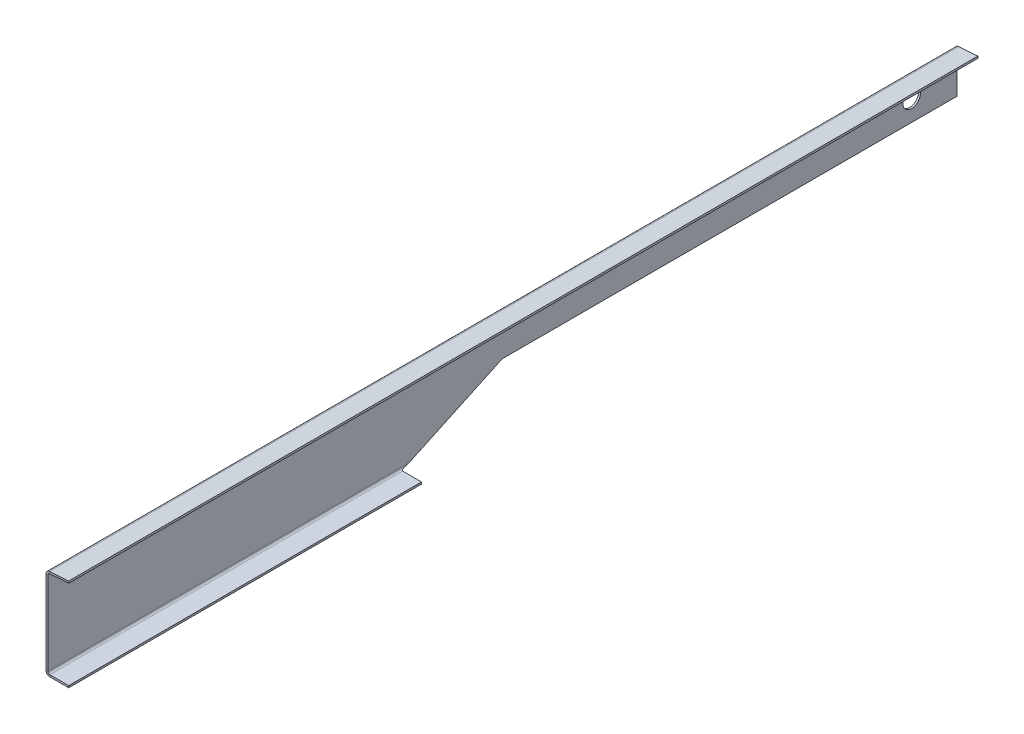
ISO-10303-21;
HEADER;
FILE_DESCRIPTION(('STEP AP214'),'2;1');
FILE_NAME('part.step','',(''),(''),'','','');
FILE_SCHEMA(('AUTOMOTIVE_DESIGN { 1 0 10303 214 1 1 1 1 }'));
ENDSEC;
DATA;
#1=APPLICATION_CONTEXT('core data for automotive mechanical design processes');
#2=APPLICATION_PROTOCOL_DEFINITION('international standard','automotive_design',2000,#1);
#3=PRODUCT_CONTEXT('',#1,'mechanical');
#4=PRODUCT('Part','Part','',(#3));
#5=PRODUCT_RELATED_PRODUCT_CATEGORY('part','',(#4));
#6=PRODUCT_DEFINITION_FORMATION('','',#4);
#7=PRODUCT_DEFINITION_CONTEXT('part definition',#1,'design');
#8=PRODUCT_DEFINITION('design','',#6,#7);
#9=PRODUCT_DEFINITION_SHAPE('','',#8);
#10=(LENGTH_UNIT() NAMED_UNIT(*) SI_UNIT(.MILLI.,.METRE.));
#11=(NAMED_UNIT(*) PLANE_ANGLE_UNIT() SI_UNIT($,.RADIAN.));
#12=(NAMED_UNIT(*) SI_UNIT($,.STERADIAN.) SOLID_ANGLE_UNIT());
#13=UNCERTAINTY_MEASURE_WITH_UNIT(LENGTH_MEASURE(1.E-05),#10,'distance_accuracy_value','');
#14=(GEOMETRIC_REPRESENTATION_CONTEXT(3) GLOBAL_UNCERTAINTY_ASSIGNED_CONTEXT((#13)) GLOBAL_UNIT_ASSIGNED_CONTEXT((#10,
#11,#12)) REPRESENTATION_CONTEXT('',''));
#15=CARTESIAN_POINT('',(0.,0.,0.));
#16=DIRECTION('',(0.,0.,1.));
#17=DIRECTION('',(1.,0.,0.));
#18=AXIS2_PLACEMENT_3D('',#15,#16,#17);
#19=CARTESIAN_POINT('',(12.2570463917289,299.291590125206,-3048.));
#20=DIRECTION('',(0.,0.,-1.));
#21=DIRECTION('',(-1.,0.,0.));
#22=AXIS2_PLACEMENT_3D('',#19,#20,#21);
#23=PLANE('',#22);
#24=DIRECTION('',(0.,1.00000000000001,0.));
#25=VECTOR('',#24,1.);
#26=CARTESIAN_POINT('',(6.35000000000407,0.,-3048.));
#27=LINE('',#26,#25);
#28=CARTESIAN_POINT('',(6.35000000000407,158.75,-3048.));
#29=VERTEX_POINT('',#28);
#30=CARTESIAN_POINT('',(6.35000000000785,292.957058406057,-3048.));
#31=VERTEX_POINT('',#30);
#32=EDGE_CURVE('E135',#29,#31,#27,.T.);
#33=ORIENTED_EDGE('',*,*,#32,.F.);
#34=DIRECTION('',(1.,0.,0.));
#35=VECTOR('',#34,1.);
#36=CARTESIAN_POINT('',(6.35000000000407,158.75,-3048.));
#37=LINE('',#36,#35);
#38=CARTESIAN_POINT('',(3.99680288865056E-12,158.750000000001,-3048.));
#39=VERTEX_POINT('',#38);
#40=EDGE_CURVE('E131',#29,#39,#37,.F.);
#41=ORIENTED_EDGE('',*,*,#40,.T.);
#42=DIRECTION('',(0.,1.00000000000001,0.));
#43=VECTOR('',#42,1.);
#44=CARTESIAN_POINT('',(3.99680288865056E-12,0.,-3048.));
#45=LINE('',#44,#43);
#46=CARTESIAN_POINT('',(7.99360577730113E-12,292.957058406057,-3048.));
#47=VERTEX_POINT('',#46);
#48=EDGE_CURVE('E126',#39,#47,#45,.T.);
#49=ORIENTED_EDGE('',*,*,#48,.T.);
#50=DIRECTION('',(1.,0.,0.));
#51=VECTOR('',#50,1.);
#52=CARTESIAN_POINT('',(7.99360577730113E-12,292.957058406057,-3048.));
#53=LINE('',#52,#51);
#54=EDGE_CURVE('E11',#47,#31,#53,.T.);
#55=ORIENTED_EDGE('',*,*,#54,.T.);
#56=EDGE_LOOP('',(#33,#41,#49,#55));
#57=FACE_BOUND('',#56,.T.);
#58=ADVANCED_FACE('F36',(#57),#23,.T.);
#59=CARTESIAN_POINT('',(6.35000000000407,0.,-3048.));
#60=DIRECTION('',(1.,0.,0.));
#61=DIRECTION('',(0.,0.,-1.));
#62=AXIS2_PLACEMENT_3D('',#59,#60,#61);
#63=PLANE('',#62);
#64=CARTESIAN_POINT('',(6.35000000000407,228.600000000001,-2895.6));
#65=DIRECTION('',(1.,0.,0.));
#66=DIRECTION('',(0.,0.,-1.));
#67=AXIS2_PLACEMENT_3D('',#64,#65,#66);
#68=CIRCLE('',#67,29.3687500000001);
#69=CARTESIAN_POINT('',(6.35000000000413,228.600000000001,-2924.96875));
#70=VERTEX_POINT('',#69);
#71=EDGE_CURVE('E325',#70,#70,#68,.T.);
#72=ORIENTED_EDGE('',*,*,#71,.F.);
#73=EDGE_LOOP('',(#72));
#74=FACE_BOUND('',#73,.T.);
#75=DIRECTION('',(0.,-0.422618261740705,0.906307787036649));
#76=VECTOR('',#75,1.);
#77=CARTESIAN_POINT('',(6.35000000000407,714.456137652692,-2714.84363159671));
#78=LINE('',#77,#76);
#79=CARTESIAN_POINT('',(6.35000000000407,158.750000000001,-1523.12797363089));
#80=VERTEX_POINT('',#79);
#81=CARTESIAN_POINT('',(6.35000000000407,12.7000000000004,-1209.92273789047));
#82=VERTEX_POINT('',#81);
#83=EDGE_CURVE('E308',#80,#82,#78,.T.);
#84=ORIENTED_EDGE('',*,*,#83,.F.);
#85=DIRECTION('',(0.,0.,1.));
#86=VECTOR('',#85,1.);
#87=CARTESIAN_POINT('',(6.35000000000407,158.75,-3048.));
#88=LINE('',#87,#86);
#89=EDGE_CURVE('E302',#29,#80,#88,.T.);
#90=ORIENTED_EDGE('',*,*,#89,.F.);
#91=ORIENTED_EDGE('',*,*,#32,.T.);
#92=DIRECTION('',(0.,0.,1.));
#93=VECTOR('',#92,1.);
#94=CARTESIAN_POINT('',(6.35000000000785,292.957058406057,-3048.));
#95=LINE('',#94,#93);
#96=CARTESIAN_POINT('',(6.35000000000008,292.957058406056,0.));
#97=VERTEX_POINT('',#96);
#98=EDGE_CURVE('E200',#31,#97,#95,.T.);
#99=ORIENTED_EDGE('',*,*,#98,.T.);
#100=DIRECTION('',(0.,1.00000000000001,0.));
#101=VECTOR('',#100,1.);
#102=CARTESIAN_POINT('',(6.35000000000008,0.,0.));
#103=LINE('',#102,#101);
#104=CARTESIAN_POINT('',(6.35000000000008,12.7000000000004,0.));
#105=VERTEX_POINT('',#104);
#106=EDGE_CURVE('E190',#105,#97,#103,.T.);
#107=ORIENTED_EDGE('',*,*,#106,.F.);
#108=DIRECTION('',(0.,0.,1.));
#109=VECTOR('',#108,1.);
#110=CARTESIAN_POINT('',(6.35000000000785,12.7000000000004,-3048.));
#111=LINE('',#110,#109);
#112=EDGE_CURVE('E203',#82,#105,#111,.T.);
#113=ORIENTED_EDGE('',*,*,#112,.F.);
#114=EDGE_LOOP('',(#84,#90,#91,#99,#107,#113));
#115=FACE_BOUND('',#114,.T.);
#116=ADVANCED_FACE('F238',(#74,#115),#63,.T.);
#117=CARTESIAN_POINT('',(12.7000000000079,12.7000000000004,-3048.));
#118=DIRECTION('',(0.,0.,1.));
#119=DIRECTION('',(1.,0.,0.));
#120=AXIS2_PLACEMENT_3D('',#117,#118,#119);
#121=CYLINDRICAL_SURFACE('',#120,6.35);
#122=DIRECTION('',(0.,0.,1.));
#123=VECTOR('',#122,1.);
#124=CARTESIAN_POINT('',(12.7000000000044,6.35000000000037,-3048.));
#125=LINE('',#124,#123);
#126=CARTESIAN_POINT('',(12.7000000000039,6.35000000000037,-1182.6875));
#127=VERTEX_POINT('',#126);
#128=CARTESIAN_POINT('',(12.7000000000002,6.35000000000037,0.));
#129=VERTEX_POINT('',#128);
#130=EDGE_CURVE('E205',#127,#129,#125,.T.);
#131=ORIENTED_EDGE('',*,*,#130,.F.);
#132=CARTESIAN_POINT('',(12.7000000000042,12.7000000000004,-1209.92273789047));
#133=DIRECTION('',(0.,0.973879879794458,0.227063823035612));
#134=DIRECTION('',(0.,-0.227063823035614,0.97387987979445));
#135=AXIS2_PLACEMENT_3D('',#132,#133,#134);
#136=ELLIPSE('',#135,27.9657054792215,6.35);
#137=EDGE_CURVE('E285',#82,#127,#136,.T.);
#138=ORIENTED_EDGE('',*,*,#137,.F.);
#139=ORIENTED_EDGE('',*,*,#112,.T.);
#140=CARTESIAN_POINT('',(12.7000000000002,12.7000000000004,0.));
#141=DIRECTION('',(0.,0.,1.));
#142=DIRECTION('',(1.,0.,0.));
#143=AXIS2_PLACEMENT_3D('',#140,#141,#142);
#144=CIRCLE('',#143,6.35);
#145=EDGE_CURVE('E187',#129,#105,#144,.F.);
#146=ORIENTED_EDGE('',*,*,#145,.F.);
#147=EDGE_LOOP('',(#131,#138,#139,#146));
#148=FACE_BOUND('',#147,.T.);
#149=ADVANCED_FACE('F282',(#148),#121,.F.);
#150=CARTESIAN_POINT('',(76.2000000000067,6.35000000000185,-3048.));
#151=DIRECTION('',(0.,1.00000000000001,0.));
#152=DIRECTION('',(-1.,0.,0.));
#153=AXIS2_PLACEMENT_3D('',#150,#151,#152);
#154=PLANE('',#153);
#155=DIRECTION('',(0.,0.,1.));
#156=VECTOR('',#155,1.);
#157=CARTESIAN_POINT('',(76.2000000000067,6.35000000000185,-3048.));
#158=LINE('',#157,#156);
#159=CARTESIAN_POINT('',(76.2000000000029,6.35000000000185,-1182.6875));
#160=VERTEX_POINT('',#159);
#161=CARTESIAN_POINT('',(76.1999999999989,6.35000000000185,0.));
#162=VERTEX_POINT('',#161);
#163=EDGE_CURVE('E207',#160,#162,#158,.T.);
#164=ORIENTED_EDGE('',*,*,#163,.F.);
#165=DIRECTION('',(-1.,0.,0.));
#166=VECTOR('',#165,1.);
#167=CARTESIAN_POINT('',(76.2000000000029,6.35000000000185,-1182.6875));
#168=LINE('',#167,#166);
#169=EDGE_CURVE('E279',#160,#127,#168,.T.);
#170=ORIENTED_EDGE('',*,*,#169,.T.);
#171=ORIENTED_EDGE('',*,*,#130,.T.);
#172=DIRECTION('',(-1.,0.,0.));
#173=VECTOR('',#172,1.);
#174=CARTESIAN_POINT('',(76.1999999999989,6.35000000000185,0.));
#175=LINE('',#174,#173);
#176=EDGE_CURVE('E184',#162,#129,#175,.T.);
#177=ORIENTED_EDGE('',*,*,#176,.F.);
#178=EDGE_LOOP('',(#164,#170,#171,#177));
#179=FACE_BOUND('',#178,.T.);
#180=ADVANCED_FACE('F273',(#179),#154,.T.);
#181=CARTESIAN_POINT('',(76.2000000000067,6.35000000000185,-3048.));
#182=DIRECTION('',(-1.,0.,0.));
#183=DIRECTION('',(0.,-1.00000000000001,0.));
#184=AXIS2_PLACEMENT_3D('',#181,#182,#183);
#185=PLANE('',#184);
#186=DIRECTION('',(0.,-1.00000000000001,0.));
#187=VECTOR('',#186,1.);
#188=CARTESIAN_POINT('',(76.2000000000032,0.,-1182.6875));
#189=LINE('',#188,#187);
#190=CARTESIAN_POINT('',(76.2000000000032,0.,-1182.6875));
#191=VERTEX_POINT('',#190);
#192=EDGE_CURVE('E309',#191,#160,#189,.F.);
#193=ORIENTED_EDGE('',*,*,#192,.T.);
#194=ORIENTED_EDGE('',*,*,#163,.T.);
#195=DIRECTION('',(0.,-1.00000000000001,0.));
#196=VECTOR('',#195,1.);
#197=CARTESIAN_POINT('',(76.1999999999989,6.35000000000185,0.));
#198=LINE('',#197,#196);
#199=CARTESIAN_POINT('',(76.1999999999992,1.78111553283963E-12,0.));
#200=VERTEX_POINT('',#199);
#201=EDGE_CURVE('E181',#162,#200,#198,.T.);
#202=ORIENTED_EDGE('',*,*,#201,.T.);
#203=DIRECTION('',(0.,0.,1.));
#204=VECTOR('',#203,1.);
#205=CARTESIAN_POINT('',(76.2000000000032,1.78111553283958E-12,-3048.));
#206=LINE('',#205,#204);
#207=EDGE_CURVE('E209',#191,#200,#206,.T.);
#208=ORIENTED_EDGE('',*,*,#207,.F.);
#209=EDGE_LOOP('',(#193,#194,#202,#208));
#210=FACE_BOUND('',#209,.T.);
#211=ADVANCED_FACE('F270',(#210),#185,.F.);
#212=CARTESIAN_POINT('',(76.2000000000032,1.78111553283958E-12,-3048.));
#213=DIRECTION('',(0.,1.00000000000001,0.));
#214=DIRECTION('',(-1.,0.,0.));
#215=AXIS2_PLACEMENT_3D('',#212,#213,#214);
#216=PLANE('',#215);
#217=DIRECTION('',(-1.,0.,0.));
#218=VECTOR('',#217,1.);
#219=CARTESIAN_POINT('',(76.4573342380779,0.,-1182.6875));
#220=LINE('',#219,#218);
#221=CARTESIAN_POINT('',(12.7000000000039,0.,-1182.6875));
#222=VERTEX_POINT('',#221);
#223=EDGE_CURVE('E267',#191,#222,#220,.T.);
#224=ORIENTED_EDGE('',*,*,#223,.F.);
#225=ORIENTED_EDGE('',*,*,#207,.T.);
#226=DIRECTION('',(-1.,0.,0.));
#227=VECTOR('',#226,1.);
#228=CARTESIAN_POINT('',(76.1999999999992,1.78111553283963E-12,0.));
#229=LINE('',#228,#227);
#230=CARTESIAN_POINT('',(12.7000000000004,2.96852588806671E-13,0.));
#231=VERTEX_POINT('',#230);
#232=EDGE_CURVE('E178',#200,#231,#229,.T.);
#233=ORIENTED_EDGE('',*,*,#232,.T.);
#234=DIRECTION('',(0.,0.,1.));
#235=VECTOR('',#234,1.);
#236=CARTESIAN_POINT('',(12.7000000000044,2.96852588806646E-13,-3048.));
#237=LINE('',#236,#235);
#238=EDGE_CURVE('E211',#222,#231,#237,.T.);
#239=ORIENTED_EDGE('',*,*,#238,.F.);
#240=EDGE_LOOP('',(#224,#225,#233,#239));
#241=FACE_BOUND('',#240,.T.);
#242=ADVANCED_FACE('F263',(#241),#216,.F.);
#243=CARTESIAN_POINT('',(12.7000000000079,12.7000000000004,-3048.));
#244=DIRECTION('',(0.,0.,1.));
#245=DIRECTION('',(1.,0.,0.));
#246=AXIS2_PLACEMENT_3D('',#243,#244,#245);
#247=CYLINDRICAL_SURFACE('',#246,12.7);
#248=CARTESIAN_POINT('',(12.7000000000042,12.7000000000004,-1209.92273789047));
#249=DIRECTION('',(0.,0.906307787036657,0.422618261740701));
#250=DIRECTION('',(0.,-0.422618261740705,0.906307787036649));
#251=AXIS2_PLACEMENT_3D('',#248,#249,#250);
#252=ELLIPSE('',#251,30.0507601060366,12.7);
#253=CARTESIAN_POINT('',(3.99680288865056E-12,12.7000000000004,-1209.92273789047));
#254=VERTEX_POINT('',#253);
#255=EDGE_CURVE('E255',#254,#222,#252,.T.);
#256=ORIENTED_EDGE('',*,*,#255,.T.);
#257=ORIENTED_EDGE('',*,*,#238,.T.);
#258=CARTESIAN_POINT('',(12.7000000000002,12.7000000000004,0.));
#259=DIRECTION('',(0.,0.,-1.));
#260=DIRECTION('',(-1.,0.,0.));
#261=AXIS2_PLACEMENT_3D('',#258,#259,#260);
#262=CIRCLE('',#261,12.7);
#263=CARTESIAN_POINT('',(0.,12.7000000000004,0.));
#264=VERTEX_POINT('',#263);
#265=EDGE_CURVE('E175',#231,#264,#262,.T.);
#266=ORIENTED_EDGE('',*,*,#265,.T.);
#267=DIRECTION('',(0.,0.,1.));
#268=VECTOR('',#267,1.);
#269=CARTESIAN_POINT('',(7.99360577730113E-12,12.7000000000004,-3048.));
#270=LINE('',#269,#268);
#271=EDGE_CURVE('E151',#254,#264,#270,.T.);
#272=ORIENTED_EDGE('',*,*,#271,.F.);
#273=EDGE_LOOP('',(#256,#257,#266,#272));
#274=FACE_BOUND('',#273,.T.);
#275=ADVANCED_FACE('F252',(#274),#247,.T.);
#276=CARTESIAN_POINT('',(3.99680288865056E-12,0.,-3048.));
#277=DIRECTION('',(1.,0.,0.));
#278=DIRECTION('',(0.,0.,-1.));
#279=AXIS2_PLACEMENT_3D('',#276,#277,#278);
#280=PLANE('',#279);
#281=CARTESIAN_POINT('',(3.99680288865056E-12,228.600000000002,-2895.6));
#282=DIRECTION('',(-1.,0.,0.));
#283=DIRECTION('',(0.,0.,1.));
#284=AXIS2_PLACEMENT_3D('',#281,#282,#283);
#285=CIRCLE('',#284,29.3687500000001);
#286=CARTESIAN_POINT('',(3.93811233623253E-12,228.600000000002,-2866.23125));
#287=VERTEX_POINT('',#286);
#288=EDGE_CURVE('E329',#287,#287,#285,.T.);
#289=ORIENTED_EDGE('',*,*,#288,.F.);
#290=EDGE_LOOP('',(#289));
#291=FACE_BOUND('',#290,.T.);
#292=DIRECTION('',(0.,0.,-1.));
#293=VECTOR('',#292,1.);
#294=CARTESIAN_POINT('',(3.99680288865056E-12,158.750000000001,-3048.));
#295=LINE('',#294,#293);
#296=CARTESIAN_POINT('',(3.99680288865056E-12,158.750000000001,-1523.12797363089));
#297=VERTEX_POINT('',#296);
#298=EDGE_CURVE('E305',#39,#297,#295,.F.);
#299=ORIENTED_EDGE('',*,*,#298,.T.);
#300=DIRECTION('',(0.,-0.422618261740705,0.906307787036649));
#301=VECTOR('',#300,1.);
#302=CARTESIAN_POINT('',(3.99680288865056E-12,714.45613765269,-2714.84363159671));
#303=LINE('',#302,#301);
#304=EDGE_CURVE('E315',#297,#254,#303,.T.);
#305=ORIENTED_EDGE('',*,*,#304,.T.);
#306=ORIENTED_EDGE('',*,*,#271,.T.);
#307=DIRECTION('',(0.,1.00000000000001,0.));
#308=VECTOR('',#307,1.);
#309=CARTESIAN_POINT('',(0.,0.,0.));
#310=LINE('',#309,#308);
#311=CARTESIAN_POINT('',(0.,292.957058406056,0.));
#312=VERTEX_POINT('',#311);
#313=EDGE_CURVE('E147',#264,#312,#310,.T.);
#314=ORIENTED_EDGE('',*,*,#313,.T.);
#315=DIRECTION('',(0.,0.,1.));
#316=VECTOR('',#315,1.);
#317=CARTESIAN_POINT('',(7.99360577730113E-12,292.957058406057,-3048.));
#318=LINE('',#317,#316);
#319=EDGE_CURVE('E144',#47,#312,#318,.T.);
#320=ORIENTED_EDGE('',*,*,#319,.F.);
#321=ORIENTED_EDGE('',*,*,#48,.F.);
#322=EDGE_LOOP('',(#299,#305,#306,#314,#320,#321));
#323=FACE_BOUND('',#322,.T.);
#324=ADVANCED_FACE('F145',(#291,#323),#280,.F.);
#325=CARTESIAN_POINT('',(7.99360577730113E-12,292.957058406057,-3048.));
#326=DIRECTION('',(0.,0.,-1.));
#327=DIRECTION('',(-1.,0.,0.));
#328=AXIS2_PLACEMENT_3D('',#325,#326,#327);
#329=PLANE('',#328);
#330=ORIENTED_EDGE('',*,*,#54,.F.);
#331=CARTESIAN_POINT('',(12.7000000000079,292.957058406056,-3048.));
#332=DIRECTION('',(0.,0.,-1.));
#333=DIRECTION('',(-1.,0.,0.));
#334=AXIS2_PLACEMENT_3D('',#331,#332,#333);
#335=CIRCLE('',#334,12.7);
#336=CARTESIAN_POINT('',(11.8140927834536,305.626121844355,-3048.));
#337=VERTEX_POINT('',#336);
#338=EDGE_CURVE('E136',#47,#337,#335,.T.);
#339=ORIENTED_EDGE('',*,*,#338,.T.);
#340=DIRECTION('',(-0.0697564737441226,0.997564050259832,0.));
#341=VECTOR('',#340,1.);
#342=CARTESIAN_POINT('',(12.2570463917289,299.291590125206,-3048.));
#343=LINE('',#342,#341);
#344=CARTESIAN_POINT('',(12.2570463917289,299.291590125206,-3048.));
#345=VERTEX_POINT('',#344);
#346=EDGE_CURVE('E44',#345,#337,#343,.T.);
#347=ORIENTED_EDGE('',*,*,#346,.F.);
#348=CARTESIAN_POINT('',(12.7000000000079,292.957058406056,-3048.));
#349=DIRECTION('',(0.,0.,1.));
#350=DIRECTION('',(1.,0.,0.));
#351=AXIS2_PLACEMENT_3D('',#348,#349,#350);
#352=CIRCLE('',#351,6.35);
#353=EDGE_CURVE('E141',#31,#345,#352,.F.);
#354=ORIENTED_EDGE('',*,*,#353,.F.);
#355=EDGE_LOOP('',(#330,#339,#347,#354));
#356=FACE_BOUND('',#355,.T.);
#357=ADVANCED_FACE('F38',(#356),#329,.T.);
#358=CARTESIAN_POINT('',(11.8140927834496,305.626121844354,0.));
#359=DIRECTION('',(0.,0.,1.));
#360=DIRECTION('',(1.,0.,0.));
#361=AXIS2_PLACEMENT_3D('',#358,#359,#360);
#362=PLANE('',#361);
#363=DIRECTION('',(0.0697564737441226,-0.997564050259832,0.));
#364=VECTOR('',#363,1.);
#365=CARTESIAN_POINT('',(11.8140927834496,305.626121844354,0.));
#366=LINE('',#365,#364);
#367=CARTESIAN_POINT('',(11.8140927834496,305.626121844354,0.));
#368=VERTEX_POINT('',#367);
#369=CARTESIAN_POINT('',(12.2570463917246,299.291590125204,0.));
#370=VERTEX_POINT('',#369);
#371=EDGE_CURVE('E105',#368,#370,#366,.T.);
#372=ORIENTED_EDGE('',*,*,#371,.F.);
#373=CARTESIAN_POINT('',(12.7000000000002,292.957058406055,0.));
#374=DIRECTION('',(0.,0.,-1.));
#375=DIRECTION('',(-1.,0.,0.));
#376=AXIS2_PLACEMENT_3D('',#373,#374,#375);
#377=CIRCLE('',#376,12.7);
#378=EDGE_CURVE('E172',#312,#368,#377,.T.);
#379=ORIENTED_EDGE('',*,*,#378,.F.);
#380=DIRECTION('',(-1.,0.,0.));
#381=VECTOR('',#380,1.);
#382=CARTESIAN_POINT('',(6.35000000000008,292.957058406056,0.));
#383=LINE('',#382,#381);
#384=EDGE_CURVE('E224',#97,#312,#383,.T.);
#385=ORIENTED_EDGE('',*,*,#384,.F.);
#386=CARTESIAN_POINT('',(12.7000000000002,292.957058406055,0.));
#387=DIRECTION('',(0.,0.,1.));
#388=DIRECTION('',(1.,0.,0.));
#389=AXIS2_PLACEMENT_3D('',#386,#387,#388);
#390=CIRCLE('',#389,6.35);
#391=EDGE_CURVE('E193',#97,#370,#390,.F.);
#392=ORIENTED_EDGE('',*,*,#391,.T.);
#393=EDGE_LOOP('',(#372,#379,#385,#392));
#394=FACE_BOUND('',#393,.T.);
#395=ADVANCED_FACE('F341',(#394),#362,.T.);
#396=CARTESIAN_POINT('',(6.35000000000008,292.957058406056,0.));
#397=DIRECTION('',(0.,0.,1.));
#398=DIRECTION('',(1.,0.,0.));
#399=AXIS2_PLACEMENT_3D('',#396,#397,#398);
#400=PLANE('',#399);
#401=DIRECTION('',(0.997564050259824,0.069756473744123,0.));
#402=VECTOR('',#401,1.);
#403=CARTESIAN_POINT('',(0.,304.800000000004,0.));
#404=LINE('',#403,#402);
#405=CARTESIAN_POINT('',(76.0143806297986,310.115443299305,0.));
#406=VERTEX_POINT('',#405);
#407=EDGE_CURVE('E170',#368,#406,#404,.T.);
#408=ORIENTED_EDGE('',*,*,#407,.F.);
#409=ORIENTED_EDGE('',*,*,#371,.T.);
#410=DIRECTION('',(0.997564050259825,0.069756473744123,0.));
#411=VECTOR('',#410,1.);
#412=CARTESIAN_POINT('',(0.442953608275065,298.465468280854,0.));
#413=LINE('',#412,#411);
#414=CARTESIAN_POINT('',(76.4573342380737,303.780911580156,0.));
#415=VERTEX_POINT('',#414);
#416=EDGE_CURVE('E165',#370,#415,#413,.T.);
#417=ORIENTED_EDGE('',*,*,#416,.T.);
#418=DIRECTION('',(0.0697564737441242,-0.997564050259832,0.));
#419=VECTOR('',#418,1.);
#420=CARTESIAN_POINT('',(76.0143806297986,310.115443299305,0.));
#421=LINE('',#420,#419);
#422=EDGE_CURVE('E167',#406,#415,#421,.T.);
#423=ORIENTED_EDGE('',*,*,#422,.F.);
#424=EDGE_LOOP('',(#408,#409,#417,#423));
#425=FACE_BOUND('',#424,.T.);
#426=ADVANCED_FACE('F353',(#425),#400,.T.);
#427=CARTESIAN_POINT('',(0.,12.7000000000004,0.));
#428=DIRECTION('',(0.,0.,1.));
#429=DIRECTION('',(1.,0.,0.));
#430=AXIS2_PLACEMENT_3D('',#427,#428,#429);
#431=PLANE('',#430);
#432=DIRECTION('',(1.,0.,0.));
#433=VECTOR('',#432,1.);
#434=CARTESIAN_POINT('',(0.,12.7000000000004,0.));
#435=LINE('',#434,#433);
#436=EDGE_CURVE('E221',#264,#105,#435,.T.);
#437=ORIENTED_EDGE('',*,*,#436,.F.);
#438=ORIENTED_EDGE('',*,*,#265,.F.);
#439=DIRECTION('',(0.,-1.00000000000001,0.));
#440=VECTOR('',#439,1.);
#441=CARTESIAN_POINT('',(12.7000000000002,6.35000000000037,0.));
#442=LINE('',#441,#440);
#443=EDGE_CURVE('E199',#129,#231,#442,.T.);
#444=ORIENTED_EDGE('',*,*,#443,.F.);
#445=ORIENTED_EDGE('',*,*,#145,.T.);
#446=EDGE_LOOP('',(#437,#438,#444,#445));
#447=FACE_BOUND('',#446,.T.);
#448=ADVANCED_FACE('F246',(#447),#431,.T.);
#449=CARTESIAN_POINT('',(12.7000000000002,6.35000000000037,0.));
#450=DIRECTION('',(0.,0.,1.));
#451=DIRECTION('',(1.,0.,0.));
#452=AXIS2_PLACEMENT_3D('',#449,#450,#451);
#453=PLANE('',#452);
#454=ORIENTED_EDGE('',*,*,#313,.F.);
#455=ORIENTED_EDGE('',*,*,#436,.T.);
#456=ORIENTED_EDGE('',*,*,#106,.T.);
#457=ORIENTED_EDGE('',*,*,#384,.T.);
#458=EDGE_LOOP('',(#454,#455,#456,#457));
#459=FACE_BOUND('',#458,.T.);
#460=ADVANCED_FACE('F242',(#459),#453,.T.);
#461=CARTESIAN_POINT('',(0.442953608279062,298.465468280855,-3048.));
#462=DIRECTION('',(0.0697564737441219,-0.997564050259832,0.));
#463=DIRECTION('',(0.997564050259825,0.069756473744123,0.));
#464=AXIS2_PLACEMENT_3D('',#461,#462,#463);
#465=PLANE('',#464);
#466=ORIENTED_EDGE('',*,*,#416,.F.);
#467=DIRECTION('',(0.,0.,1.));
#468=VECTOR('',#467,1.);
#469=CARTESIAN_POINT('',(12.2570463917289,299.291590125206,-3048.));
#470=LINE('',#469,#468);
#471=EDGE_CURVE('E197',#345,#370,#470,.T.);
#472=ORIENTED_EDGE('',*,*,#471,.F.);
#473=DIRECTION('',(0.997564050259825,0.069756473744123,0.));
#474=VECTOR('',#473,1.);
#475=CARTESIAN_POINT('',(0.442953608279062,298.465468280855,-3048.));
#476=LINE('',#475,#474);
#477=CARTESIAN_POINT('',(76.4573342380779,303.780911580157,-3048.));
#478=VERTEX_POINT('',#477);
#479=EDGE_CURVE('E196',#345,#478,#476,.T.);
#480=ORIENTED_EDGE('',*,*,#479,.T.);
#481=DIRECTION('',(0.,0.,1.));
#482=VECTOR('',#481,1.);
#483=CARTESIAN_POINT('',(76.4573342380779,303.780911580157,-3048.));
#484=LINE('',#483,#482);
#485=EDGE_CURVE('E164',#478,#415,#484,.T.);
#486=ORIENTED_EDGE('',*,*,#485,.T.);
#487=EDGE_LOOP('',(#466,#472,#480,#486));
#488=FACE_BOUND('',#487,.T.);
#489=ADVANCED_FACE('F361',(#488),#465,.T.);
#490=CARTESIAN_POINT('',(12.7000000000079,292.957058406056,-3048.));
#491=DIRECTION('',(0.,0.,1.));
#492=DIRECTION('',(1.,0.,0.));
#493=AXIS2_PLACEMENT_3D('',#490,#491,#492);
#494=CYLINDRICAL_SURFACE('',#493,6.35);
#495=ORIENTED_EDGE('',*,*,#391,.F.);
#496=ORIENTED_EDGE('',*,*,#98,.F.);
#497=ORIENTED_EDGE('',*,*,#353,.T.);
#498=ORIENTED_EDGE('',*,*,#471,.T.);
#499=EDGE_LOOP('',(#495,#496,#497,#498));
#500=FACE_BOUND('',#499,.T.);
#501=ADVANCED_FACE('F233',(#500),#494,.F.);
#502=CARTESIAN_POINT('',(12.7000000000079,292.957058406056,-3048.));
#503=DIRECTION('',(0.,0.,1.));
#504=DIRECTION('',(1.,0.,0.));
#505=AXIS2_PLACEMENT_3D('',#502,#503,#504);
#506=CYLINDRICAL_SURFACE('',#505,12.7);
#507=ORIENTED_EDGE('',*,*,#378,.T.);
#508=DIRECTION('',(0.,0.,1.));
#509=VECTOR('',#508,1.);
#510=CARTESIAN_POINT('',(11.8140927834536,305.626121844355,-3048.));
#511=LINE('',#510,#509);
#512=EDGE_CURVE('E152',#337,#368,#511,.T.);
#513=ORIENTED_EDGE('',*,*,#512,.F.);
#514=ORIENTED_EDGE('',*,*,#338,.F.);
#515=ORIENTED_EDGE('',*,*,#319,.T.);
#516=EDGE_LOOP('',(#507,#513,#514,#515));
#517=FACE_BOUND('',#516,.T.);
#518=ADVANCED_FACE('F154',(#517),#506,.T.);
#519=CARTESIAN_POINT('',(3.99680288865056E-12,304.800000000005,-3048.));
#520=DIRECTION('',(0.069756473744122,-0.997564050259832,0.));
#521=DIRECTION('',(0.997564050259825,0.069756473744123,0.));
#522=AXIS2_PLACEMENT_3D('',#519,#520,#521);
#523=PLANE('',#522);
#524=ORIENTED_EDGE('',*,*,#407,.T.);
#525=DIRECTION('',(0.,0.,1.));
#526=VECTOR('',#525,1.);
#527=CARTESIAN_POINT('',(76.0143806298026,310.115443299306,-3048.));
#528=LINE('',#527,#526);
#529=CARTESIAN_POINT('',(76.0143806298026,310.115443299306,-3048.));
#530=VERTEX_POINT('',#529);
#531=EDGE_CURVE('E215',#530,#406,#528,.T.);
#532=ORIENTED_EDGE('',*,*,#531,.F.);
#533=DIRECTION('',(0.997564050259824,0.069756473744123,0.));
#534=VECTOR('',#533,1.);
#535=CARTESIAN_POINT('',(3.99680288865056E-12,304.800000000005,-3048.));
#536=LINE('',#535,#534);
#537=EDGE_CURVE('E157',#337,#530,#536,.T.);
#538=ORIENTED_EDGE('',*,*,#537,.F.);
#539=ORIENTED_EDGE('',*,*,#512,.T.);
#540=EDGE_LOOP('',(#524,#532,#538,#539));
#541=FACE_BOUND('',#540,.T.);
#542=ADVANCED_FACE('F367',(#541),#523,.F.);
#543=CARTESIAN_POINT('',(76.0143806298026,310.115443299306,-3048.));
#544=DIRECTION('',(-0.997564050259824,-0.0697564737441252,0.));
#545=DIRECTION('',(0.0697564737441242,-0.997564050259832,0.));
#546=AXIS2_PLACEMENT_3D('',#543,#544,#545);
#547=PLANE('',#546);
#548=ORIENTED_EDGE('',*,*,#422,.T.);
#549=ORIENTED_EDGE('',*,*,#485,.F.);
#550=DIRECTION('',(0.0697564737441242,-0.997564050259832,0.));
#551=VECTOR('',#550,1.);
#552=CARTESIAN_POINT('',(76.0143806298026,310.115443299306,-3048.));
#553=LINE('',#552,#551);
#554=EDGE_CURVE('E114',#530,#478,#553,.T.);
#555=ORIENTED_EDGE('',*,*,#554,.F.);
#556=ORIENTED_EDGE('',*,*,#531,.T.);
#557=EDGE_LOOP('',(#548,#549,#555,#556));
#558=FACE_BOUND('',#557,.T.);
#559=ADVANCED_FACE('F364',(#558),#547,.F.);
#560=CARTESIAN_POINT('',(12.7000000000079,292.957058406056,-3048.));
#561=DIRECTION('',(0.,0.,-1.));
#562=DIRECTION('',(-1.,0.,0.));
#563=AXIS2_PLACEMENT_3D('',#560,#561,#562);
#564=PLANE('',#563);
#565=ORIENTED_EDGE('',*,*,#479,.F.);
#566=ORIENTED_EDGE('',*,*,#346,.T.);
#567=ORIENTED_EDGE('',*,*,#537,.T.);
#568=ORIENTED_EDGE('',*,*,#554,.T.);
#569=EDGE_LOOP('',(#565,#566,#567,#568));
#570=FACE_BOUND('',#569,.T.);
#571=ADVANCED_FACE('F226',(#570),#564,.T.);
#572=CARTESIAN_POINT('',(12.7000000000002,292.957058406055,0.));
#573=DIRECTION('',(0.,0.,-1.));
#574=DIRECTION('',(-1.,0.,0.));
#575=AXIS2_PLACEMENT_3D('',#572,#573,#574);
#576=PLANE('',#575);
#577=ORIENTED_EDGE('',*,*,#176,.T.);
#578=ORIENTED_EDGE('',*,*,#443,.T.);
#579=ORIENTED_EDGE('',*,*,#232,.F.);
#580=ORIENTED_EDGE('',*,*,#201,.F.);
#581=EDGE_LOOP('',(#577,#578,#579,#580));
#582=FACE_BOUND('',#581,.T.);
#583=ADVANCED_FACE('F260',(#582),#576,.F.);
#584=CARTESIAN_POINT('',(6.35000000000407,158.75,-3048.));
#585=DIRECTION('',(0.,1.00000000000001,0.));
#586=DIRECTION('',(0.,0.,1.));
#587=AXIS2_PLACEMENT_3D('',#584,#585,#586);
#588=PLANE('',#587);
#589=ORIENTED_EDGE('',*,*,#40,.F.);
#590=ORIENTED_EDGE('',*,*,#89,.T.);
#591=DIRECTION('',(1.,0.,0.));
#592=VECTOR('',#591,1.);
#593=CARTESIAN_POINT('',(6.35000000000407,158.750000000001,-1523.12797363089));
#594=LINE('',#593,#592);
#595=EDGE_CURVE('E306',#80,#297,#594,.F.);
#596=ORIENTED_EDGE('',*,*,#595,.T.);
#597=ORIENTED_EDGE('',*,*,#298,.F.);
#598=EDGE_LOOP('',(#589,#590,#596,#597));
#599=FACE_BOUND('',#598,.T.);
#600=ADVANCED_FACE('F304',(#599),#588,.F.);
#601=CARTESIAN_POINT('',(6.35000000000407,714.456137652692,-2714.84363159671));
#602=DIRECTION('',(0.,0.906307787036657,0.422618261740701));
#603=DIRECTION('',(0.,-0.422618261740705,0.906307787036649));
#604=AXIS2_PLACEMENT_3D('',#601,#602,#603);
#605=PLANE('',#604);
#606=ORIENTED_EDGE('',*,*,#83,.T.);
#607=DIRECTION('',(1.,0.,0.));
#608=VECTOR('',#607,1.);
#609=CARTESIAN_POINT('',(6.35000000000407,12.7000000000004,-1209.92273789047));
#610=LINE('',#609,#608);
#611=EDGE_CURVE('E51',#82,#254,#610,.F.);
#612=ORIENTED_EDGE('',*,*,#611,.T.);
#613=ORIENTED_EDGE('',*,*,#304,.F.);
#614=ORIENTED_EDGE('',*,*,#595,.F.);
#615=EDGE_LOOP('',(#606,#612,#613,#614));
#616=FACE_BOUND('',#615,.T.);
#617=ADVANCED_FACE('F491',(#616),#605,.F.);
#618=CARTESIAN_POINT('',(76.4573342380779,0.,-1182.6875));
#619=DIRECTION('',(0.,0.,-1.));
#620=DIRECTION('',(-1.,0.,0.));
#621=AXIS2_PLACEMENT_3D('',#618,#619,#620);
#622=PLANE('',#621);
#623=ORIENTED_EDGE('',*,*,#192,.F.);
#624=ORIENTED_EDGE('',*,*,#223,.T.);
#625=DIRECTION('',(0.,-1.00000000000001,0.));
#626=VECTOR('',#625,1.);
#627=CARTESIAN_POINT('',(12.7000000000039,0.,-1182.6875));
#628=LINE('',#627,#626);
#629=EDGE_CURVE('E312',#222,#127,#628,.F.);
#630=ORIENTED_EDGE('',*,*,#629,.T.);
#631=ORIENTED_EDGE('',*,*,#169,.F.);
#632=EDGE_LOOP('',(#623,#624,#630,#631));
#633=FACE_BOUND('',#632,.T.);
#634=ADVANCED_FACE('F502',(#633),#622,.T.);
#635=CARTESIAN_POINT('',(12.7000000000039,6.35000000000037,-1182.6875));
#636=CARTESIAN_POINT('',(12.7000000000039,4.23333333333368,-1182.6875));
#637=CARTESIAN_POINT('',(12.7000000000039,2.11666666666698,-1182.6875));
#638=CARTESIAN_POINT('',(12.7000000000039,2.97430829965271E-13,-1182.6875));
#639=CARTESIAN_POINT('',(25.400000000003,6.35000000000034,-1182.6875));
#640=CARTESIAN_POINT('',(29.6333333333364,4.23333333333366,-1182.6875));
#641=CARTESIAN_POINT('',(33.8666666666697,2.11666666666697,-1182.6875));
#642=CARTESIAN_POINT('',(38.100000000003,2.99017061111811E-13,-1182.6875));
#643=CARTESIAN_POINT('',(25.400000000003,19.0500000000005,-1237.15797578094));
#644=CARTESIAN_POINT('',(29.6333333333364,21.1666666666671,-1237.15797578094));
#645=CARTESIAN_POINT('',(33.8666666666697,23.2833333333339,-1237.15797578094));
#646=CARTESIAN_POINT('',(38.1000000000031,25.4000000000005,-1237.15797578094));
#647=CARTESIAN_POINT('',(12.7000000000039,19.0500000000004,-1237.15797578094));
#648=CARTESIAN_POINT('',(12.7000000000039,21.1666666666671,-1237.15797578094));
#649=CARTESIAN_POINT('',(12.7000000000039,23.2833333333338,-1237.15797578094));
#650=CARTESIAN_POINT('',(12.7000000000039,25.4000000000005,-1237.15797578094));
#651=CARTESIAN_POINT('',(2.99760216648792E-12,19.0500000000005,-1237.15797578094));
#652=CARTESIAN_POINT('',(-4.23333333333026,21.1666666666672,-1237.15797578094));
#653=CARTESIAN_POINT('',(-8.46666666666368,23.2833333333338,-1237.15797578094));
#654=CARTESIAN_POINT('',(-12.6999999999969,25.4000000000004,-1237.15797578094));
#655=CARTESIAN_POINT('',(2.99760216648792E-12,6.35000000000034,-1182.6875));
#656=CARTESIAN_POINT('',(-4.23333333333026,4.23333333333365,-1182.6875));
#657=CARTESIAN_POINT('',(-8.46666666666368,2.11666666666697,-1182.6875));
#658=CARTESIAN_POINT('',(-12.6999999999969,2.95844598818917E-13,-1182.6875));
#659=CARTESIAN_POINT('',(12.7000000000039,6.35000000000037,-1182.6875));
#660=CARTESIAN_POINT('',(12.7000000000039,4.23333333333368,-1182.6875));
#661=CARTESIAN_POINT('',(12.7000000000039,2.11666666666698,-1182.6875));
#662=CARTESIAN_POINT('',(12.7000000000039,2.97430829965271E-13,-1182.6875));
#663=(BOUNDED_SURFACE() B_SPLINE_SURFACE(3,3,((#635,#636,#637,#638),(#639,#640,#641,#642),(#643,
#644,#645,#646),(#647,#648,#649,#650),(#651,#652,#653,#654),(#655,#656,#657,#658),(#659,#660,
#661,#662)),.UNSPECIFIED.,.T.,.F.,.F.) B_SPLINE_SURFACE_WITH_KNOTS((4,3,4),(4,4),(0.,0.5,1.),
(0.,1.),.UNSPECIFIED.) GEOMETRIC_REPRESENTATION_ITEM() RATIONAL_B_SPLINE_SURFACE(((1.,1.,1.,1.),
(0.333333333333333,0.333333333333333,0.333333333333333,0.333333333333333),(0.333333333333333,
0.333333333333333,0.333333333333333,0.333333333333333),(1.,1.,1.,1.),(0.333333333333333,
0.333333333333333,0.333333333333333,0.333333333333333),(0.333333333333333,0.333333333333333,
0.333333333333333,0.333333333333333),(1.,1.,1.,1.))) REPRESENTATION_ITEM('') SURFACE());
#664=ORIENTED_EDGE('',*,*,#629,.F.);
#665=ORIENTED_EDGE('',*,*,#255,.F.);
#666=ORIENTED_EDGE('',*,*,#611,.F.);
#667=ORIENTED_EDGE('',*,*,#137,.T.);
#668=EDGE_LOOP('',(#664,#665,#666,#667));
#669=FACE_BOUND('',#668,.T.);
#670=ADVANCED_FACE('F512',(#669),#663,.T.);
#671=CARTESIAN_POINT('',(76.4573342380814,228.600000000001,-2895.6));
#672=DIRECTION('',(-1.,0.,0.));
#673=DIRECTION('',(0.,0.,1.));
#674=AXIS2_PLACEMENT_3D('',#671,#672,#673);
#675=CYLINDRICAL_SURFACE('',#674,29.3687500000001);
#676=ORIENTED_EDGE('',*,*,#71,.T.);
#677=EDGE_LOOP('',(#676));
#678=FACE_BOUND('',#677,.T.);
#679=ORIENTED_EDGE('',*,*,#288,.T.);
#680=EDGE_LOOP('',(#679));
#681=FACE_BOUND('',#680,.T.);
#682=ADVANCED_FACE('F333',(#678,#681),#675,.F.);
#683=CLOSED_SHELL('',(#58,#116,#149,#180,#211,#242,#275,#324,#357,#395,#426,#448,#460,#489,#501,
#518,#542,#559,#571,#583,#600,#617,#634,#670,#682));
#684=MANIFOLD_SOLID_BREP('B2',#683);
#685=ADVANCED_BREP_SHAPE_REPRESENTATION('',(#18,#684),#14);
#686=SHAPE_DEFINITION_REPRESENTATION(#9,#685);
ENDSEC;
END-ISO-10303-21;
